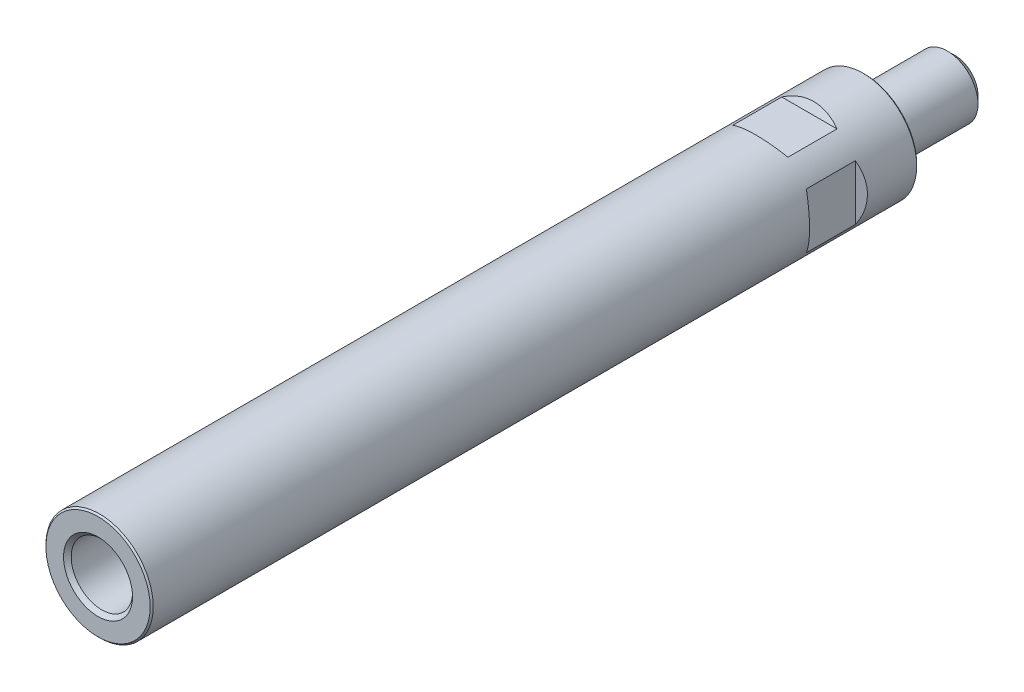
ISO-10303-21;
HEADER;
FILE_DESCRIPTION(('STEP AP214'),'2;1');
FILE_NAME('part.step','',(''),(''),'','','');
FILE_SCHEMA(('AUTOMOTIVE_DESIGN { 1 0 10303 214 1 1 1 1 }'));
ENDSEC;
DATA;
#1=APPLICATION_CONTEXT('core data for automotive mechanical design processes');
#2=APPLICATION_PROTOCOL_DEFINITION('international standard','automotive_design',2000,#1);
#3=PRODUCT_CONTEXT('',#1,'mechanical');
#4=PRODUCT('Part','Part','',(#3));
#5=PRODUCT_RELATED_PRODUCT_CATEGORY('part','',(#4));
#6=PRODUCT_DEFINITION_FORMATION('','',#4);
#7=PRODUCT_DEFINITION_CONTEXT('part definition',#1,'design');
#8=PRODUCT_DEFINITION('design','',#6,#7);
#9=PRODUCT_DEFINITION_SHAPE('','',#8);
#10=(LENGTH_UNIT() NAMED_UNIT(*) SI_UNIT(.MILLI.,.METRE.));
#11=(NAMED_UNIT(*) PLANE_ANGLE_UNIT() SI_UNIT($,.RADIAN.));
#12=(NAMED_UNIT(*) SI_UNIT($,.STERADIAN.) SOLID_ANGLE_UNIT());
#13=UNCERTAINTY_MEASURE_WITH_UNIT(LENGTH_MEASURE(1.E-05),#10,'distance_accuracy_value','');
#14=(GEOMETRIC_REPRESENTATION_CONTEXT(3) GLOBAL_UNCERTAINTY_ASSIGNED_CONTEXT((#13)) GLOBAL_UNIT_ASSIGNED_CONTEXT((#10,
#11,#12)) REPRESENTATION_CONTEXT('',''));
#15=CARTESIAN_POINT('',(0.,0.,0.));
#16=DIRECTION('',(0.,0.,1.));
#17=DIRECTION('',(1.,0.,0.));
#18=AXIS2_PLACEMENT_3D('',#15,#16,#17);
#19=CARTESIAN_POINT('',(0.,0.,-9.5));
#20=DIRECTION('',(0.,0.,1.));
#21=DIRECTION('',(1.,0.,0.));
#22=AXIS2_PLACEMENT_3D('',#19,#20,#21);
#23=CYLINDRICAL_SURFACE('',#22,10.);
#24=CARTESIAN_POINT('',(0.,0.,-27.));
#25=DIRECTION('',(0.,0.,1.));
#26=DIRECTION('',(1.,0.,0.));
#27=AXIS2_PLACEMENT_3D('',#24,#25,#26);
#28=CIRCLE('',#27,10.);
#29=CARTESIAN_POINT('',(10.,0.,-27.));
#30=VERTEX_POINT('',#29);
#31=EDGE_CURVE('E249',#30,#30,#28,.T.);
#32=ORIENTED_EDGE('',*,*,#31,.T.);
#33=EDGE_LOOP('',(#32));
#34=FACE_BOUND('',#33,.T.);
#35=CARTESIAN_POINT('',(0.,0.,1.25));
#36=DIRECTION('',(0.,0.,-1.));
#37=DIRECTION('',(-1.,0.,0.));
#38=AXIS2_PLACEMENT_3D('',#35,#36,#37);
#39=CIRCLE('',#38,10.);
#40=CARTESIAN_POINT('',(-10.,0.,1.25));
#41=VERTEX_POINT('',#40);
#42=EDGE_CURVE('E26',#41,#41,#39,.T.);
#43=ORIENTED_EDGE('',*,*,#42,.T.);
#44=EDGE_LOOP('',(#43));
#45=FACE_BOUND('',#44,.T.);
#46=ADVANCED_FACE('F15',(#34,#45),#23,.T.);
#47=CARTESIAN_POINT('',(0.,0.,-27.));
#48=DIRECTION('',(0.,0.,1.));
#49=DIRECTION('',(1.,0.,0.));
#50=AXIS2_PLACEMENT_3D('',#47,#48,#49);
#51=CONICAL_SURFACE('',#50,10.,0.785398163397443);
#52=CARTESIAN_POINT('',(0.,0.,-29.5));
#53=DIRECTION('',(0.,0.,1.));
#54=DIRECTION('',(1.,0.,0.));
#55=AXIS2_PLACEMENT_3D('',#52,#53,#54);
#56=CIRCLE('',#55,7.5);
#57=CARTESIAN_POINT('',(7.5,0.,-29.5));
#58=VERTEX_POINT('',#57);
#59=EDGE_CURVE('E19',#58,#58,#56,.T.);
#60=ORIENTED_EDGE('',*,*,#59,.T.);
#61=EDGE_LOOP('',(#60));
#62=FACE_BOUND('',#61,.T.);
#63=ORIENTED_EDGE('',*,*,#31,.F.);
#64=EDGE_LOOP('',(#63));
#65=FACE_BOUND('',#64,.T.);
#66=ADVANCED_FACE('F302',(#62,#65),#51,.T.);
#67=CARTESIAN_POINT('',(0.,0.,-29.5));
#68=DIRECTION('',(0.,0.,1.));
#69=DIRECTION('',(1.,0.,0.));
#70=AXIS2_PLACEMENT_3D('',#67,#68,#69);
#71=PLANE('',#70);
#72=ORIENTED_EDGE('',*,*,#59,.F.);
#73=EDGE_LOOP('',(#72));
#74=FACE_BOUND('',#73,.T.);
#75=ADVANCED_FACE('F17',(#74),#71,.F.);
#76=CARTESIAN_POINT('',(0.,0.,0.));
#77=DIRECTION('',(0.,0.,-1.));
#78=DIRECTION('',(-1.,0.,0.));
#79=AXIS2_PLACEMENT_3D('',#76,#77,#78);
#80=CONICAL_SURFACE('',#79,11.25,0.785398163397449);
#81=CARTESIAN_POINT('',(0.,0.,0.));
#82=DIRECTION('',(0.,0.,-1.));
#83=DIRECTION('',(-1.,0.,0.));
#84=AXIS2_PLACEMENT_3D('',#81,#82,#83);
#85=CIRCLE('',#84,11.25);
#86=CARTESIAN_POINT('',(-11.25,0.,0.));
#87=VERTEX_POINT('',#86);
#88=EDGE_CURVE('E202',#87,#87,#85,.T.);
#89=ORIENTED_EDGE('',*,*,#88,.T.);
#90=EDGE_LOOP('',(#89));
#91=FACE_BOUND('',#90,.T.);
#92=ORIENTED_EDGE('',*,*,#42,.F.);
#93=EDGE_LOOP('',(#92));
#94=FACE_BOUND('',#93,.T.);
#95=ADVANCED_FACE('F301',(#91,#94),#80,.F.);
#96=CARTESIAN_POINT('',(0.,0.,0.));
#97=DIRECTION('',(0.,0.,1.));
#98=DIRECTION('',(1.,0.,0.));
#99=AXIS2_PLACEMENT_3D('',#96,#97,#98);
#100=PLANE('',#99);
#101=CARTESIAN_POINT('',(0.,0.,0.));
#102=DIRECTION('',(0.,0.,1.));
#103=DIRECTION('',(1.,0.,0.));
#104=AXIS2_PLACEMENT_3D('',#101,#102,#103);
#105=CIRCLE('',#104,17.);
#106=CARTESIAN_POINT('',(17.,0.,0.));
#107=VERTEX_POINT('',#106);
#108=EDGE_CURVE('E193',#107,#107,#105,.F.);
#109=ORIENTED_EDGE('',*,*,#108,.T.);
#110=EDGE_LOOP('',(#109));
#111=FACE_BOUND('',#110,.T.);
#112=ORIENTED_EDGE('',*,*,#88,.F.);
#113=EDGE_LOOP('',(#112));
#114=FACE_BOUND('',#113,.T.);
#115=ADVANCED_FACE('F308',(#111,#114),#100,.F.);
#116=CARTESIAN_POINT('',(0.,0.,0.500000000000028));
#117=DIRECTION('',(0.,0.,1.));
#118=DIRECTION('',(1.,0.,0.));
#119=AXIS2_PLACEMENT_3D('',#116,#117,#118);
#120=CONICAL_SURFACE('',#119,17.5,0.785398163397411);
#121=ORIENTED_EDGE('',*,*,#108,.F.);
#122=EDGE_LOOP('',(#121));
#123=FACE_BOUND('',#122,.T.);
#124=CARTESIAN_POINT('',(0.,0.,0.500000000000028));
#125=DIRECTION('',(0.,0.,1.));
#126=DIRECTION('',(1.,0.,0.));
#127=AXIS2_PLACEMENT_3D('',#124,#125,#126);
#128=CIRCLE('',#127,17.5);
#129=CARTESIAN_POINT('',(17.5,0.,0.500000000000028));
#130=VERTEX_POINT('',#129);
#131=EDGE_CURVE('E190',#130,#130,#128,.T.);
#132=ORIENTED_EDGE('',*,*,#131,.F.);
#133=EDGE_LOOP('',(#132));
#134=FACE_BOUND('',#133,.T.);
#135=ADVANCED_FACE('F357',(#123,#134),#120,.T.);
#136=CARTESIAN_POINT('',(0.,0.,250.));
#137=DIRECTION('',(0.,0.,-1.));
#138=DIRECTION('',(-1.,0.,0.));
#139=AXIS2_PLACEMENT_3D('',#136,#137,#138);
#140=CYLINDRICAL_SURFACE('',#139,17.5);
#141=ORIENTED_EDGE('',*,*,#131,.T.);
#142=EDGE_LOOP('',(#141));
#143=FACE_BOUND('',#142,.T.);
#144=CARTESIAN_POINT('',(0.,0.,249.5));
#145=DIRECTION('',(0.,0.,1.));
#146=DIRECTION('',(1.,0.,0.));
#147=AXIS2_PLACEMENT_3D('',#144,#145,#146);
#148=CIRCLE('',#147,17.5);
#149=CARTESIAN_POINT('',(17.5,0.,249.5));
#150=VERTEX_POINT('',#149);
#151=EDGE_CURVE('E187',#150,#150,#148,.F.);
#152=ORIENTED_EDGE('',*,*,#151,.T.);
#153=EDGE_LOOP('',(#152));
#154=FACE_BOUND('',#153,.T.);
#155=CARTESIAN_POINT('',(0.,0.,26.6602540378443));
#156=DIRECTION('',(0.5,0.,-0.86602540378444));
#157=DIRECTION('',(-0.86602540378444,0.,-0.5));
#158=AXIS2_PLACEMENT_3D('',#155,#156,#157);
#159=ELLIPSE('',#158,20.2072594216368,17.5);
#160=CARTESIAN_POINT('',(-15.,-9.01387818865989,18.));
#161=VERTEX_POINT('',#160);
#162=CARTESIAN_POINT('',(-15.,9.01387818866,18.));
#163=VERTEX_POINT('',#162);
#164=EDGE_CURVE('E176',#161,#163,#159,.T.);
#165=ORIENTED_EDGE('',*,*,#164,.T.);
#166=DIRECTION('',(0.,0.,-1.));
#167=VECTOR('',#166,1.);
#168=CARTESIAN_POINT('',(-15.,9.01387818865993,250.));
#169=LINE('',#168,#167);
#170=CARTESIAN_POINT('',(-15.,9.01387818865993,34.));
#171=VERTEX_POINT('',#170);
#172=EDGE_CURVE('E184',#163,#171,#169,.F.);
#173=ORIENTED_EDGE('',*,*,#172,.T.);
#174=CARTESIAN_POINT('',(0.,0.,25.3397459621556));
#175=DIRECTION('',(0.5,0.,0.86602540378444));
#176=DIRECTION('',(0.86602540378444,0.,-0.5));
#177=AXIS2_PLACEMENT_3D('',#174,#175,#176);
#178=ELLIPSE('',#177,20.2072594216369,17.5);
#179=CARTESIAN_POINT('',(-15.,-9.01387818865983,34.));
#180=VERTEX_POINT('',#179);
#181=EDGE_CURVE('E181',#171,#180,#178,.T.);
#182=ORIENTED_EDGE('',*,*,#181,.T.);
#183=DIRECTION('',(0.,0.,-1.));
#184=VECTOR('',#183,1.);
#185=CARTESIAN_POINT('',(-15.,-9.01387818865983,250.));
#186=LINE('',#185,#184);
#187=EDGE_CURVE('E178',#180,#161,#186,.T.);
#188=ORIENTED_EDGE('',*,*,#187,.T.);
#189=EDGE_LOOP('',(#165,#173,#182,#188));
#190=FACE_BOUND('',#189,.T.);
#191=CARTESIAN_POINT('',(0.,0.,26.6602540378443));
#192=DIRECTION('',(-0.5,0.,-0.86602540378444));
#193=DIRECTION('',(0.86602540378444,0.,-0.5));
#194=AXIS2_PLACEMENT_3D('',#191,#192,#193);
#195=ELLIPSE('',#194,20.2072594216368,17.5);
#196=CARTESIAN_POINT('',(15.,9.01387818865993,18.));
#197=VERTEX_POINT('',#196);
#198=CARTESIAN_POINT('',(15.,-9.01387818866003,18.));
#199=VERTEX_POINT('',#198);
#200=EDGE_CURVE('E174',#197,#199,#195,.T.);
#201=ORIENTED_EDGE('',*,*,#200,.T.);
#202=DIRECTION('',(0.,0.,-1.));
#203=VECTOR('',#202,1.);
#204=CARTESIAN_POINT('',(15.,-9.01387818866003,250.));
#205=LINE('',#204,#203);
#206=CARTESIAN_POINT('',(15.,-9.01387818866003,34.));
#207=VERTEX_POINT('',#206);
#208=EDGE_CURVE('E168',#199,#207,#205,.F.);
#209=ORIENTED_EDGE('',*,*,#208,.T.);
#210=CARTESIAN_POINT('',(0.,0.,25.3397459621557));
#211=DIRECTION('',(-0.5,0.,0.86602540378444));
#212=DIRECTION('',(-0.86602540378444,0.,-0.5));
#213=AXIS2_PLACEMENT_3D('',#210,#211,#212);
#214=ELLIPSE('',#213,20.2072594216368,17.5);
#215=CARTESIAN_POINT('',(15.,9.01387818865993,34.));
#216=VERTEX_POINT('',#215);
#217=EDGE_CURVE('E165',#207,#216,#214,.T.);
#218=ORIENTED_EDGE('',*,*,#217,.T.);
#219=DIRECTION('',(0.,0.,-1.));
#220=VECTOR('',#219,1.);
#221=CARTESIAN_POINT('',(15.,9.01387818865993,250.));
#222=LINE('',#221,#220);
#223=EDGE_CURVE('E171',#216,#197,#222,.T.);
#224=ORIENTED_EDGE('',*,*,#223,.T.);
#225=EDGE_LOOP('',(#201,#209,#218,#224));
#226=FACE_BOUND('',#225,.T.);
#227=CARTESIAN_POINT('',(0.,0.,26.6602540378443));
#228=DIRECTION('',(0.,0.5,-0.86602540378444));
#229=DIRECTION('',(0.,-0.86602540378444,-0.5));
#230=AXIS2_PLACEMENT_3D('',#227,#228,#229);
#231=ELLIPSE('',#230,20.2072594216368,17.5);
#232=CARTESIAN_POINT('',(9.01387818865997,-15.,18.));
#233=VERTEX_POINT('',#232);
#234=CARTESIAN_POINT('',(-9.01387818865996,-15.,18.));
#235=VERTEX_POINT('',#234);
#236=EDGE_CURVE('E136',#233,#235,#231,.T.);
#237=ORIENTED_EDGE('',*,*,#236,.T.);
#238=DIRECTION('',(0.,0.,-1.));
#239=VECTOR('',#238,1.);
#240=CARTESIAN_POINT('',(-9.01387818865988,-15.,250.));
#241=LINE('',#240,#239);
#242=CARTESIAN_POINT('',(-9.01387818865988,-15.,34.));
#243=VERTEX_POINT('',#242);
#244=EDGE_CURVE('E162',#235,#243,#241,.F.);
#245=ORIENTED_EDGE('',*,*,#244,.T.);
#246=CARTESIAN_POINT('',(0.,0.,25.3397459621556));
#247=DIRECTION('',(0.,0.5,0.86602540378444));
#248=DIRECTION('',(0.,0.86602540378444,-0.5));
#249=AXIS2_PLACEMENT_3D('',#246,#247,#248);
#250=ELLIPSE('',#249,20.2072594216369,17.5);
#251=CARTESIAN_POINT('',(9.01387818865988,-15.,34.));
#252=VERTEX_POINT('',#251);
#253=EDGE_CURVE('E159',#243,#252,#250,.T.);
#254=ORIENTED_EDGE('',*,*,#253,.T.);
#255=DIRECTION('',(0.,0.,-1.));
#256=VECTOR('',#255,1.);
#257=CARTESIAN_POINT('',(9.01387818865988,-15.,250.));
#258=LINE('',#257,#256);
#259=EDGE_CURVE('E156',#252,#233,#258,.T.);
#260=ORIENTED_EDGE('',*,*,#259,.T.);
#261=EDGE_LOOP('',(#237,#245,#254,#260));
#262=FACE_BOUND('',#261,.T.);
#263=CARTESIAN_POINT('',(0.,0.,26.6602540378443));
#264=DIRECTION('',(0.,-0.5,-0.86602540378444));
#265=DIRECTION('',(0.,0.86602540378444,-0.5));
#266=AXIS2_PLACEMENT_3D('',#263,#264,#265);
#267=ELLIPSE('',#266,20.2072594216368,17.5);
#268=CARTESIAN_POINT('',(-9.01387818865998,15.,18.));
#269=VERTEX_POINT('',#268);
#270=CARTESIAN_POINT('',(9.01387818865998,15.,18.));
#271=VERTEX_POINT('',#270);
#272=EDGE_CURVE('E126',#269,#271,#267,.T.);
#273=ORIENTED_EDGE('',*,*,#272,.T.);
#274=DIRECTION('',(0.,0.,-1.));
#275=VECTOR('',#274,1.);
#276=CARTESIAN_POINT('',(9.01387818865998,15.,250.));
#277=LINE('',#276,#275);
#278=CARTESIAN_POINT('',(9.01387818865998,15.,34.));
#279=VERTEX_POINT('',#278);
#280=EDGE_CURVE('E130',#271,#279,#277,.F.);
#281=ORIENTED_EDGE('',*,*,#280,.T.);
#282=CARTESIAN_POINT('',(0.,0.,25.3397459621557));
#283=DIRECTION('',(0.,-0.5,0.86602540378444));
#284=DIRECTION('',(0.,-0.86602540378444,-0.5));
#285=AXIS2_PLACEMENT_3D('',#282,#283,#284);
#286=ELLIPSE('',#285,20.2072594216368,17.5);
#287=CARTESIAN_POINT('',(-9.01387818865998,15.,34.));
#288=VERTEX_POINT('',#287);
#289=EDGE_CURVE('E143',#279,#288,#286,.T.);
#290=ORIENTED_EDGE('',*,*,#289,.T.);
#291=DIRECTION('',(0.,0.,-1.));
#292=VECTOR('',#291,1.);
#293=CARTESIAN_POINT('',(-9.01387818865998,15.,250.));
#294=LINE('',#293,#292);
#295=EDGE_CURVE('E132',#288,#269,#294,.T.);
#296=ORIENTED_EDGE('',*,*,#295,.T.);
#297=EDGE_LOOP('',(#273,#281,#290,#296));
#298=FACE_BOUND('',#297,.T.);
#299=ADVANCED_FACE('F128',(#143,#154,#190,#226,#262,#298),#140,.T.);
#300=CARTESIAN_POINT('',(0.,0.,250.));
#301=DIRECTION('',(0.,0.,-1.));
#302=DIRECTION('',(-1.,0.,0.));
#303=AXIS2_PLACEMENT_3D('',#300,#301,#302);
#304=CONICAL_SURFACE('',#303,17.,0.785398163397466);
#305=ORIENTED_EDGE('',*,*,#151,.F.);
#306=EDGE_LOOP('',(#305));
#307=FACE_BOUND('',#306,.T.);
#308=CARTESIAN_POINT('',(0.,0.,250.));
#309=DIRECTION('',(0.,0.,1.));
#310=DIRECTION('',(1.,0.,0.));
#311=AXIS2_PLACEMENT_3D('',#308,#309,#310);
#312=CIRCLE('',#311,17.);
#313=CARTESIAN_POINT('',(17.,0.,250.));
#314=VERTEX_POINT('',#313);
#315=EDGE_CURVE('E196',#314,#314,#312,.T.);
#316=ORIENTED_EDGE('',*,*,#315,.F.);
#317=EDGE_LOOP('',(#316));
#318=FACE_BOUND('',#317,.T.);
#319=ADVANCED_FACE('F352',(#307,#318),#304,.T.);
#320=CARTESIAN_POINT('',(-15.,10.,18.));
#321=DIRECTION('',(0.5,0.,-0.86602540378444));
#322=DIRECTION('',(-0.86602540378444,0.,-0.5));
#323=AXIS2_PLACEMENT_3D('',#320,#321,#322);
#324=PLANE('',#323);
#325=ORIENTED_EDGE('',*,*,#164,.F.);
#326=DIRECTION('',(0.,-1.,0.));
#327=VECTOR('',#326,1.);
#328=CARTESIAN_POINT('',(-15.,10.,18.));
#329=LINE('',#328,#327);
#330=EDGE_CURVE('E269',#163,#161,#329,.T.);
#331=ORIENTED_EDGE('',*,*,#330,.F.);
#332=EDGE_LOOP('',(#325,#331));
#333=FACE_BOUND('',#332,.T.);
#334=ADVANCED_FACE('F355',(#333),#324,.F.);
#335=CARTESIAN_POINT('',(-15.,10.,34.));
#336=DIRECTION('',(1.,0.,0.));
#337=DIRECTION('',(0.,1.,0.));
#338=AXIS2_PLACEMENT_3D('',#335,#336,#337);
#339=PLANE('',#338);
#340=DIRECTION('',(0.,-1.,0.));
#341=VECTOR('',#340,1.);
#342=CARTESIAN_POINT('',(-15.,10.,34.));
#343=LINE('',#342,#341);
#344=EDGE_CURVE('E270',#171,#180,#343,.T.);
#345=ORIENTED_EDGE('',*,*,#344,.F.);
#346=ORIENTED_EDGE('',*,*,#172,.F.);
#347=ORIENTED_EDGE('',*,*,#330,.T.);
#348=ORIENTED_EDGE('',*,*,#187,.F.);
#349=EDGE_LOOP('',(#345,#346,#347,#348));
#350=FACE_BOUND('',#349,.T.);
#351=ADVANCED_FACE('F551',(#350),#339,.F.);
#352=CARTESIAN_POINT('',(-17.5,10.,35.443375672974));
#353=DIRECTION('',(0.5,0.,0.86602540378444));
#354=DIRECTION('',(0.86602540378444,0.,-0.5));
#355=AXIS2_PLACEMENT_3D('',#352,#353,#354);
#356=PLANE('',#355);
#357=ORIENTED_EDGE('',*,*,#344,.T.);
#358=ORIENTED_EDGE('',*,*,#181,.F.);
#359=EDGE_LOOP('',(#357,#358));
#360=FACE_BOUND('',#359,.T.);
#361=ADVANCED_FACE('F542',(#360),#356,.F.);
#362=CARTESIAN_POINT('',(15.,10.,18.));
#363=DIRECTION('',(-0.5,0.,-0.86602540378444));
#364=DIRECTION('',(-0.86602540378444,0.,0.5));
#365=AXIS2_PLACEMENT_3D('',#362,#363,#364);
#366=PLANE('',#365);
#367=ORIENTED_EDGE('',*,*,#200,.F.);
#368=DIRECTION('',(0.,-1.,0.));
#369=VECTOR('',#368,1.);
#370=CARTESIAN_POINT('',(15.,10.,18.));
#371=LINE('',#370,#369);
#372=EDGE_CURVE('E275',#197,#199,#371,.T.);
#373=ORIENTED_EDGE('',*,*,#372,.T.);
#374=EDGE_LOOP('',(#367,#373));
#375=FACE_BOUND('',#374,.T.);
#376=ADVANCED_FACE('F533',(#375),#366,.F.);
#377=CARTESIAN_POINT('',(15.,10.,34.));
#378=DIRECTION('',(-1.,0.,0.));
#379=DIRECTION('',(0.,-1.,0.));
#380=AXIS2_PLACEMENT_3D('',#377,#378,#379);
#381=PLANE('',#380);
#382=DIRECTION('',(0.,-1.,0.));
#383=VECTOR('',#382,1.);
#384=CARTESIAN_POINT('',(15.,10.,34.));
#385=LINE('',#384,#383);
#386=EDGE_CURVE('E34',#216,#207,#385,.T.);
#387=ORIENTED_EDGE('',*,*,#386,.T.);
#388=ORIENTED_EDGE('',*,*,#208,.F.);
#389=ORIENTED_EDGE('',*,*,#372,.F.);
#390=ORIENTED_EDGE('',*,*,#223,.F.);
#391=EDGE_LOOP('',(#387,#388,#389,#390));
#392=FACE_BOUND('',#391,.T.);
#393=ADVANCED_FACE('F525',(#392),#381,.F.);
#394=CARTESIAN_POINT('',(17.5,10.,35.443375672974));
#395=DIRECTION('',(-0.5,0.,0.86602540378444));
#396=DIRECTION('',(0.86602540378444,0.,0.5));
#397=AXIS2_PLACEMENT_3D('',#394,#395,#396);
#398=PLANE('',#397);
#399=ORIENTED_EDGE('',*,*,#386,.F.);
#400=ORIENTED_EDGE('',*,*,#217,.F.);
#401=EDGE_LOOP('',(#399,#400));
#402=FACE_BOUND('',#401,.T.);
#403=ADVANCED_FACE('F517',(#402),#398,.F.);
#404=CARTESIAN_POINT('',(-10.,-15.,18.));
#405=DIRECTION('',(0.,0.5,-0.86602540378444));
#406=DIRECTION('',(0.,0.86602540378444,0.5));
#407=AXIS2_PLACEMENT_3D('',#404,#405,#406);
#408=PLANE('',#407);
#409=ORIENTED_EDGE('',*,*,#236,.F.);
#410=DIRECTION('',(1.,0.,0.));
#411=VECTOR('',#410,1.);
#412=CARTESIAN_POINT('',(-10.,-15.,18.));
#413=LINE('',#412,#411);
#414=EDGE_CURVE('E151',#235,#233,#413,.T.);
#415=ORIENTED_EDGE('',*,*,#414,.F.);
#416=EDGE_LOOP('',(#409,#415));
#417=FACE_BOUND('',#416,.T.);
#418=ADVANCED_FACE('F297',(#417),#408,.F.);
#419=CARTESIAN_POINT('',(-10.,-15.,34.));
#420=DIRECTION('',(0.,1.,0.));
#421=DIRECTION('',(0.,0.,1.));
#422=AXIS2_PLACEMENT_3D('',#419,#420,#421);
#423=PLANE('',#422);
#424=DIRECTION('',(1.,0.,0.));
#425=VECTOR('',#424,1.);
#426=CARTESIAN_POINT('',(-10.,-15.,34.));
#427=LINE('',#426,#425);
#428=EDGE_CURVE('E148',#243,#252,#427,.T.);
#429=ORIENTED_EDGE('',*,*,#428,.F.);
#430=ORIENTED_EDGE('',*,*,#244,.F.);
#431=ORIENTED_EDGE('',*,*,#414,.T.);
#432=ORIENTED_EDGE('',*,*,#259,.F.);
#433=EDGE_LOOP('',(#429,#430,#431,#432));
#434=FACE_BOUND('',#433,.T.);
#435=ADVANCED_FACE('F285',(#434),#423,.F.);
#436=CARTESIAN_POINT('',(-10.,-17.5,35.443375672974));
#437=DIRECTION('',(0.,0.5,0.86602540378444));
#438=DIRECTION('',(0.,-0.86602540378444,0.5));
#439=AXIS2_PLACEMENT_3D('',#436,#437,#438);
#440=PLANE('',#439);
#441=ORIENTED_EDGE('',*,*,#428,.T.);
#442=ORIENTED_EDGE('',*,*,#253,.F.);
#443=EDGE_LOOP('',(#441,#442));
#444=FACE_BOUND('',#443,.T.);
#445=ADVANCED_FACE('F288',(#444),#440,.F.);
#446=CARTESIAN_POINT('',(-10.,15.,18.));
#447=DIRECTION('',(0.,-0.5,-0.86602540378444));
#448=DIRECTION('',(0.,0.86602540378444,-0.5));
#449=AXIS2_PLACEMENT_3D('',#446,#447,#448);
#450=PLANE('',#449);
#451=ORIENTED_EDGE('',*,*,#272,.F.);
#452=DIRECTION('',(1.,0.,0.));
#453=VECTOR('',#452,1.);
#454=CARTESIAN_POINT('',(-10.,15.,18.));
#455=LINE('',#454,#453);
#456=EDGE_CURVE('E141',#269,#271,#455,.T.);
#457=ORIENTED_EDGE('',*,*,#456,.T.);
#458=EDGE_LOOP('',(#451,#457));
#459=FACE_BOUND('',#458,.T.);
#460=ADVANCED_FACE('F145',(#459),#450,.F.);
#461=CARTESIAN_POINT('',(-10.,15.,34.));
#462=DIRECTION('',(0.,-1.,0.));
#463=DIRECTION('',(0.,0.,-1.));
#464=AXIS2_PLACEMENT_3D('',#461,#462,#463);
#465=PLANE('',#464);
#466=DIRECTION('',(1.,0.,0.));
#467=VECTOR('',#466,1.);
#468=CARTESIAN_POINT('',(-10.,15.,34.));
#469=LINE('',#468,#467);
#470=EDGE_CURVE('E142',#288,#279,#469,.T.);
#471=ORIENTED_EDGE('',*,*,#470,.T.);
#472=ORIENTED_EDGE('',*,*,#280,.F.);
#473=ORIENTED_EDGE('',*,*,#456,.F.);
#474=ORIENTED_EDGE('',*,*,#295,.F.);
#475=EDGE_LOOP('',(#471,#472,#473,#474));
#476=FACE_BOUND('',#475,.T.);
#477=ADVANCED_FACE('F140',(#476),#465,.F.);
#478=CARTESIAN_POINT('',(-10.,17.5,35.443375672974));
#479=DIRECTION('',(0.,-0.5,0.86602540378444));
#480=DIRECTION('',(0.,-0.86602540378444,-0.5));
#481=AXIS2_PLACEMENT_3D('',#478,#479,#480);
#482=PLANE('',#481);
#483=ORIENTED_EDGE('',*,*,#470,.F.);
#484=ORIENTED_EDGE('',*,*,#289,.F.);
#485=EDGE_LOOP('',(#483,#484));
#486=FACE_BOUND('',#485,.T.);
#487=ADVANCED_FACE('F371',(#486),#482,.F.);
#488=CARTESIAN_POINT('',(0.,0.,250.));
#489=DIRECTION('',(0.,0.,1.));
#490=DIRECTION('',(1.,0.,0.));
#491=AXIS2_PLACEMENT_3D('',#488,#489,#490);
#492=PLANE('',#491);
#493=ORIENTED_EDGE('',*,*,#315,.T.);
#494=EDGE_LOOP('',(#493));
#495=FACE_BOUND('',#494,.T.);
#496=CARTESIAN_POINT('',(0.,0.,250.));
#497=DIRECTION('',(0.,0.,1.));
#498=DIRECTION('',(1.,0.,0.));
#499=AXIS2_PLACEMENT_3D('',#496,#497,#498);
#500=CIRCLE('',#499,11.25);
#501=CARTESIAN_POINT('',(11.25,0.,250.));
#502=VERTEX_POINT('',#501);
#503=EDGE_CURVE('E266',#502,#502,#500,.T.);
#504=ORIENTED_EDGE('',*,*,#503,.F.);
#505=EDGE_LOOP('',(#504));
#506=FACE_BOUND('',#505,.T.);
#507=ADVANCED_FACE('F367',(#495,#506),#492,.T.);
#508=CARTESIAN_POINT('',(0.,0.,250.));
#509=DIRECTION('',(0.,0.,1.));
#510=DIRECTION('',(1.,0.,0.));
#511=AXIS2_PLACEMENT_3D('',#508,#509,#510);
#512=CONICAL_SURFACE('',#511,11.25,0.785398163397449);
#513=CARTESIAN_POINT('',(0.,0.,248.75));
#514=DIRECTION('',(0.,0.,1.));
#515=DIRECTION('',(1.,0.,0.));
#516=AXIS2_PLACEMENT_3D('',#513,#514,#515);
#517=CIRCLE('',#516,10.);
#518=CARTESIAN_POINT('',(10.,0.,248.75));
#519=VERTEX_POINT('',#518);
#520=EDGE_CURVE('E199',#519,#519,#517,.F.);
#521=ORIENTED_EDGE('',*,*,#520,.T.);
#522=EDGE_LOOP('',(#521));
#523=FACE_BOUND('',#522,.T.);
#524=ORIENTED_EDGE('',*,*,#503,.T.);
#525=EDGE_LOOP('',(#524));
#526=FACE_BOUND('',#525,.T.);
#527=ADVANCED_FACE('F370',(#523,#526),#512,.F.);
#528=CARTESIAN_POINT('',(0.,0.,200.));
#529=DIRECTION('',(0.,0.,1.));
#530=DIRECTION('',(1.,0.,0.));
#531=AXIS2_PLACEMENT_3D('',#528,#529,#530);
#532=CYLINDRICAL_SURFACE('',#531,10.);
#533=CARTESIAN_POINT('',(0.,0.,200.));
#534=DIRECTION('',(0.,0.,1.));
#535=DIRECTION('',(1.,0.,0.));
#536=AXIS2_PLACEMENT_3D('',#533,#534,#535);
#537=CIRCLE('',#536,10.);
#538=CARTESIAN_POINT('',(10.,0.,200.));
#539=VERTEX_POINT('',#538);
#540=EDGE_CURVE('E203',#539,#539,#537,.T.);
#541=ORIENTED_EDGE('',*,*,#540,.F.);
#542=EDGE_LOOP('',(#541));
#543=FACE_BOUND('',#542,.T.);
#544=ORIENTED_EDGE('',*,*,#520,.F.);
#545=EDGE_LOOP('',(#544));
#546=FACE_BOUND('',#545,.T.);
#547=ADVANCED_FACE('F400',(#543,#546),#532,.F.);
#548=CARTESIAN_POINT('',(0.,0.,200.));
#549=DIRECTION('',(0.,0.,1.));
#550=DIRECTION('',(1.,0.,0.));
#551=AXIS2_PLACEMENT_3D('',#548,#549,#550);
#552=PLANE('',#551);
#553=ORIENTED_EDGE('',*,*,#540,.T.);
#554=EDGE_LOOP('',(#553));
#555=FACE_BOUND('',#554,.T.);
#556=ADVANCED_FACE('F315',(#555),#552,.T.);
#557=CLOSED_SHELL('',(#46,#66,#75,#95,#115,#135,#299,#319,#334,#351,#361,#376,#393,#403,#418,
#435,#445,#460,#477,#487,#507,#527,#547,#556));
#558=CARTESIAN_POINT('',(0.,0.,0.));
#559=DIRECTION('',(0.,0.,-1.));
#560=DIRECTION('',(-1.,0.,0.));
#561=AXIS2_PLACEMENT_3D('',#558,#559,#560);
#562=CYLINDRICAL_SURFACE('',#561,8.75);
#563=CARTESIAN_POINT('',(0.,0.,35.));
#564=DIRECTION('',(0.,0.,-1.));
#565=DIRECTION('',(-1.,0.,0.));
#566=AXIS2_PLACEMENT_3D('',#563,#564,#565);
#567=CIRCLE('',#566,8.75);
#568=CARTESIAN_POINT('',(-8.75,0.,35.));
#569=VERTEX_POINT('',#568);
#570=EDGE_CURVE('E263',#569,#569,#567,.T.);
#571=ORIENTED_EDGE('',*,*,#570,.F.);
#572=EDGE_LOOP('',(#571));
#573=FACE_BOUND('',#572,.T.);
#574=CARTESIAN_POINT('',(0.,0.,20.5));
#575=DIRECTION('',(0.,0.,-1.));
#576=DIRECTION('',(-1.,0.,0.));
#577=AXIS2_PLACEMENT_3D('',#574,#575,#576);
#578=CIRCLE('',#577,8.75);
#579=CARTESIAN_POINT('',(-8.75,0.,20.5));
#580=VERTEX_POINT('',#579);
#581=EDGE_CURVE('E9',#580,#580,#578,.F.);
#582=ORIENTED_EDGE('',*,*,#581,.F.);
#583=EDGE_LOOP('',(#582));
#584=FACE_BOUND('',#583,.T.);
#585=ADVANCED_FACE('F346',(#573,#584),#562,.F.);
#586=CARTESIAN_POINT('',(0.,0.,35.));
#587=DIRECTION('',(0.,0.,-1.));
#588=DIRECTION('',(-1.,0.,0.));
#589=AXIS2_PLACEMENT_3D('',#586,#587,#588);
#590=CONICAL_SURFACE('',#589,8.75,1.02974425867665);
#591=CARTESIAN_POINT('',(0.,0.,40.2575304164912));
#592=VERTEX_POINT('',#591);
#593=VERTEX_LOOP('',#592);
#594=FACE_BOUND('',#593,.T.);
#595=ORIENTED_EDGE('',*,*,#570,.T.);
#596=EDGE_LOOP('',(#595));
#597=FACE_BOUND('',#596,.T.);
#598=ADVANCED_FACE('F322',(#594,#597),#590,.F.);
#599=CARTESIAN_POINT('',(10.,0.,20.5));
#600=DIRECTION('',(0.,0.,-1.));
#601=DIRECTION('',(-1.,0.,0.));
#602=AXIS2_PLACEMENT_3D('',#599,#600,#601);
#603=PLANE('',#602);
#604=DIRECTION('',(0.866025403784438,-0.5,0.));
#605=VECTOR('',#604,1.);
#606=CARTESIAN_POINT('',(0.,5.77350269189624,20.5));
#607=LINE('',#606,#605);
#608=CARTESIAN_POINT('',(0.,5.77350269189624,20.5));
#609=VERTEX_POINT('',#608);
#610=CARTESIAN_POINT('',(5.,2.88675134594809,20.5));
#611=VERTEX_POINT('',#610);
#612=EDGE_CURVE('E80',#609,#611,#607,.T.);
#613=ORIENTED_EDGE('',*,*,#612,.T.);
#614=DIRECTION('',(0.,-1.,0.));
#615=VECTOR('',#614,1.);
#616=CARTESIAN_POINT('',(5.,2.88675134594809,20.5));
#617=LINE('',#616,#615);
#618=CARTESIAN_POINT('',(5.,-2.88675134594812,20.5));
#619=VERTEX_POINT('',#618);
#620=EDGE_CURVE('E219',#611,#619,#617,.T.);
#621=ORIENTED_EDGE('',*,*,#620,.T.);
#622=DIRECTION('',(0.866025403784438,0.5,0.));
#623=VECTOR('',#622,1.);
#624=CARTESIAN_POINT('',(0.,-5.77350269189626,20.5));
#625=LINE('',#624,#623);
#626=CARTESIAN_POINT('',(0.,-5.77350269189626,20.5));
#627=VERTEX_POINT('',#626);
#628=EDGE_CURVE('E216',#627,#619,#625,.T.);
#629=ORIENTED_EDGE('',*,*,#628,.F.);
#630=DIRECTION('',(-0.866025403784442,0.5,0.));
#631=VECTOR('',#630,1.);
#632=CARTESIAN_POINT('',(0.,-5.77350269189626,20.5));
#633=LINE('',#632,#631);
#634=CARTESIAN_POINT('',(-5.,-2.88675134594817,20.5));
#635=VERTEX_POINT('',#634);
#636=EDGE_CURVE('E213',#627,#635,#633,.T.);
#637=ORIENTED_EDGE('',*,*,#636,.T.);
#638=DIRECTION('',(0.,-1.,0.));
#639=VECTOR('',#638,1.);
#640=CARTESIAN_POINT('',(-5.,2.88675134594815,20.5));
#641=LINE('',#640,#639);
#642=CARTESIAN_POINT('',(-5.,2.88675134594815,20.5));
#643=VERTEX_POINT('',#642);
#644=EDGE_CURVE('E210',#643,#635,#641,.T.);
#645=ORIENTED_EDGE('',*,*,#644,.F.);
#646=DIRECTION('',(-0.866025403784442,-0.499999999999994,0.));
#647=VECTOR('',#646,1.);
#648=CARTESIAN_POINT('',(0.,5.77350269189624,20.5));
#649=LINE('',#648,#647);
#650=EDGE_CURVE('E206',#609,#643,#649,.T.);
#651=ORIENTED_EDGE('',*,*,#650,.F.);
#652=EDGE_LOOP('',(#613,#621,#629,#637,#645,#651));
#653=FACE_BOUND('',#652,.T.);
#654=ORIENTED_EDGE('',*,*,#581,.T.);
#655=EDGE_LOOP('',(#654));
#656=FACE_BOUND('',#655,.T.);
#657=ADVANCED_FACE('F318',(#653,#656),#603,.F.);
#658=CARTESIAN_POINT('',(0.,5.77350269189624,12.5));
#659=DIRECTION('',(-0.5,-0.866025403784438,0.));
#660=DIRECTION('',(0.866025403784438,-0.5,0.));
#661=AXIS2_PLACEMENT_3D('',#658,#659,#660);
#662=PLANE('',#661);
#663=DIRECTION('',(0.,0.,1.));
#664=VECTOR('',#663,1.);
#665=CARTESIAN_POINT('',(5.,2.88675134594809,12.5));
#666=LINE('',#665,#664);
#667=CARTESIAN_POINT('',(5.,2.88675134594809,12.5));
#668=VERTEX_POINT('',#667);
#669=EDGE_CURVE('E248',#668,#611,#666,.T.);
#670=ORIENTED_EDGE('',*,*,#669,.T.);
#671=ORIENTED_EDGE('',*,*,#612,.F.);
#672=DIRECTION('',(0.,0.,1.));
#673=VECTOR('',#672,1.);
#674=CARTESIAN_POINT('',(0.,5.77350269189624,12.5));
#675=LINE('',#674,#673);
#676=CARTESIAN_POINT('',(0.,5.77350269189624,12.5));
#677=VERTEX_POINT('',#676);
#678=EDGE_CURVE('E76',#677,#609,#675,.T.);
#679=ORIENTED_EDGE('',*,*,#678,.F.);
#680=DIRECTION('',(0.866025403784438,-0.5,0.));
#681=VECTOR('',#680,1.);
#682=CARTESIAN_POINT('',(0.,5.77350269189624,12.5));
#683=LINE('',#682,#681);
#684=EDGE_CURVE('E209',#677,#668,#683,.T.);
#685=ORIENTED_EDGE('',*,*,#684,.T.);
#686=EDGE_LOOP('',(#670,#671,#679,#685));
#687=FACE_BOUND('',#686,.T.);
#688=ADVANCED_FACE('F321',(#687),#662,.T.);
#689=CARTESIAN_POINT('',(5.,2.88675134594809,12.5));
#690=DIRECTION('',(-1.,0.,0.));
#691=DIRECTION('',(0.,0.,1.));
#692=AXIS2_PLACEMENT_3D('',#689,#690,#691);
#693=PLANE('',#692);
#694=DIRECTION('',(0.,0.,1.));
#695=VECTOR('',#694,1.);
#696=CARTESIAN_POINT('',(5.,-2.88675134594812,12.5));
#697=LINE('',#696,#695);
#698=CARTESIAN_POINT('',(5.,-2.88675134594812,12.5));
#699=VERTEX_POINT('',#698);
#700=EDGE_CURVE('E246',#699,#619,#697,.T.);
#701=ORIENTED_EDGE('',*,*,#700,.T.);
#702=ORIENTED_EDGE('',*,*,#620,.F.);
#703=ORIENTED_EDGE('',*,*,#669,.F.);
#704=DIRECTION('',(0.,-1.,0.));
#705=VECTOR('',#704,1.);
#706=CARTESIAN_POINT('',(5.,2.88675134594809,12.5));
#707=LINE('',#706,#705);
#708=EDGE_CURVE('E235',#668,#699,#707,.T.);
#709=ORIENTED_EDGE('',*,*,#708,.T.);
#710=EDGE_LOOP('',(#701,#702,#703,#709));
#711=FACE_BOUND('',#710,.T.);
#712=ADVANCED_FACE('F325',(#711),#693,.T.);
#713=CARTESIAN_POINT('',(0.,-5.77350269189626,12.5));
#714=DIRECTION('',(0.5,-0.866025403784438,0.));
#715=DIRECTION('',(0.866025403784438,0.5,0.));
#716=AXIS2_PLACEMENT_3D('',#713,#714,#715);
#717=PLANE('',#716);
#718=DIRECTION('',(0.,0.,1.));
#719=VECTOR('',#718,1.);
#720=CARTESIAN_POINT('',(0.,-5.77350269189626,12.5));
#721=LINE('',#720,#719);
#722=CARTESIAN_POINT('',(0.,-5.77350269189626,12.5));
#723=VERTEX_POINT('',#722);
#724=EDGE_CURVE('E244',#723,#627,#721,.T.);
#725=ORIENTED_EDGE('',*,*,#724,.T.);
#726=ORIENTED_EDGE('',*,*,#628,.T.);
#727=ORIENTED_EDGE('',*,*,#700,.F.);
#728=DIRECTION('',(0.866025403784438,0.5,0.));
#729=VECTOR('',#728,1.);
#730=CARTESIAN_POINT('',(0.,-5.77350269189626,12.5));
#731=LINE('',#730,#729);
#732=EDGE_CURVE('E232',#723,#699,#731,.T.);
#733=ORIENTED_EDGE('',*,*,#732,.F.);
#734=EDGE_LOOP('',(#725,#726,#727,#733));
#735=FACE_BOUND('',#734,.T.);
#736=ADVANCED_FACE('F328',(#735),#717,.F.);
#737=CARTESIAN_POINT('',(0.,-5.77350269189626,12.5));
#738=DIRECTION('',(0.5,0.866025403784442,0.));
#739=DIRECTION('',(-0.866025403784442,0.5,0.));
#740=AXIS2_PLACEMENT_3D('',#737,#738,#739);
#741=PLANE('',#740);
#742=DIRECTION('',(0.,0.,1.));
#743=VECTOR('',#742,1.);
#744=CARTESIAN_POINT('',(-5.,-2.88675134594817,12.5));
#745=LINE('',#744,#743);
#746=CARTESIAN_POINT('',(-5.,-2.88675134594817,12.5));
#747=VERTEX_POINT('',#746);
#748=EDGE_CURVE('E242',#747,#635,#745,.T.);
#749=ORIENTED_EDGE('',*,*,#748,.T.);
#750=ORIENTED_EDGE('',*,*,#636,.F.);
#751=ORIENTED_EDGE('',*,*,#724,.F.);
#752=DIRECTION('',(-0.866025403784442,0.5,0.));
#753=VECTOR('',#752,1.);
#754=CARTESIAN_POINT('',(0.,-5.77350269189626,12.5));
#755=LINE('',#754,#753);
#756=EDGE_CURVE('E229',#723,#747,#755,.T.);
#757=ORIENTED_EDGE('',*,*,#756,.T.);
#758=EDGE_LOOP('',(#749,#750,#751,#757));
#759=FACE_BOUND('',#758,.T.);
#760=ADVANCED_FACE('F332',(#759),#741,.T.);
#761=CARTESIAN_POINT('',(-5.,2.88675134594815,12.5));
#762=DIRECTION('',(-1.,0.,0.));
#763=DIRECTION('',(0.,-1.,0.));
#764=AXIS2_PLACEMENT_3D('',#761,#762,#763);
#765=PLANE('',#764);
#766=DIRECTION('',(0.,0.,1.));
#767=VECTOR('',#766,1.);
#768=CARTESIAN_POINT('',(-5.,2.88675134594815,12.5));
#769=LINE('',#768,#767);
#770=CARTESIAN_POINT('',(-5.,2.88675134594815,12.5));
#771=VERTEX_POINT('',#770);
#772=EDGE_CURVE('E240',#771,#643,#769,.T.);
#773=ORIENTED_EDGE('',*,*,#772,.T.);
#774=ORIENTED_EDGE('',*,*,#644,.T.);
#775=ORIENTED_EDGE('',*,*,#748,.F.);
#776=DIRECTION('',(0.,-1.,0.));
#777=VECTOR('',#776,1.);
#778=CARTESIAN_POINT('',(-5.,2.88675134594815,12.5));
#779=LINE('',#778,#777);
#780=EDGE_CURVE('E226',#771,#747,#779,.T.);
#781=ORIENTED_EDGE('',*,*,#780,.F.);
#782=EDGE_LOOP('',(#773,#774,#775,#781));
#783=FACE_BOUND('',#782,.T.);
#784=ADVANCED_FACE('F336',(#783),#765,.F.);
#785=CARTESIAN_POINT('',(0.,5.77350269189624,12.5));
#786=DIRECTION('',(-0.499999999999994,0.866025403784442,0.));
#787=DIRECTION('',(-0.866025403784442,-0.499999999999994,0.));
#788=AXIS2_PLACEMENT_3D('',#785,#786,#787);
#789=PLANE('',#788);
#790=DIRECTION('',(-0.866025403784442,-0.499999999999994,0.));
#791=VECTOR('',#790,1.);
#792=CARTESIAN_POINT('',(0.,5.77350269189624,12.5));
#793=LINE('',#792,#791);
#794=EDGE_CURVE('E223',#677,#771,#793,.T.);
#795=ORIENTED_EDGE('',*,*,#794,.F.);
#796=ORIENTED_EDGE('',*,*,#678,.T.);
#797=ORIENTED_EDGE('',*,*,#650,.T.);
#798=ORIENTED_EDGE('',*,*,#772,.F.);
#799=EDGE_LOOP('',(#795,#796,#797,#798));
#800=FACE_BOUND('',#799,.T.);
#801=ADVANCED_FACE('F340',(#800),#789,.F.);
#802=CARTESIAN_POINT('',(10.,0.,12.5));
#803=DIRECTION('',(0.,0.,1.));
#804=DIRECTION('',(1.,0.,0.));
#805=AXIS2_PLACEMENT_3D('',#802,#803,#804);
#806=PLANE('',#805);
#807=ORIENTED_EDGE('',*,*,#684,.F.);
#808=ORIENTED_EDGE('',*,*,#794,.T.);
#809=ORIENTED_EDGE('',*,*,#780,.T.);
#810=ORIENTED_EDGE('',*,*,#756,.F.);
#811=ORIENTED_EDGE('',*,*,#732,.T.);
#812=ORIENTED_EDGE('',*,*,#708,.F.);
#813=EDGE_LOOP('',(#807,#808,#809,#810,#811,#812));
#814=FACE_BOUND('',#813,.T.);
#815=ADVANCED_FACE('F342',(#814),#806,.T.);
#816=CLOSED_SHELL('',(#585,#598,#657,#688,#712,#736,#760,#784,#801,#815));
#817=ORIENTED_CLOSED_SHELL('',*,#816,.T.);
#818=BREP_WITH_VOIDS('B1',#557,(#817));
#819=ADVANCED_BREP_SHAPE_REPRESENTATION('',(#18,#818),#14);
#820=SHAPE_DEFINITION_REPRESENTATION(#9,#819);
ENDSEC;
END-ISO-10303-21;
